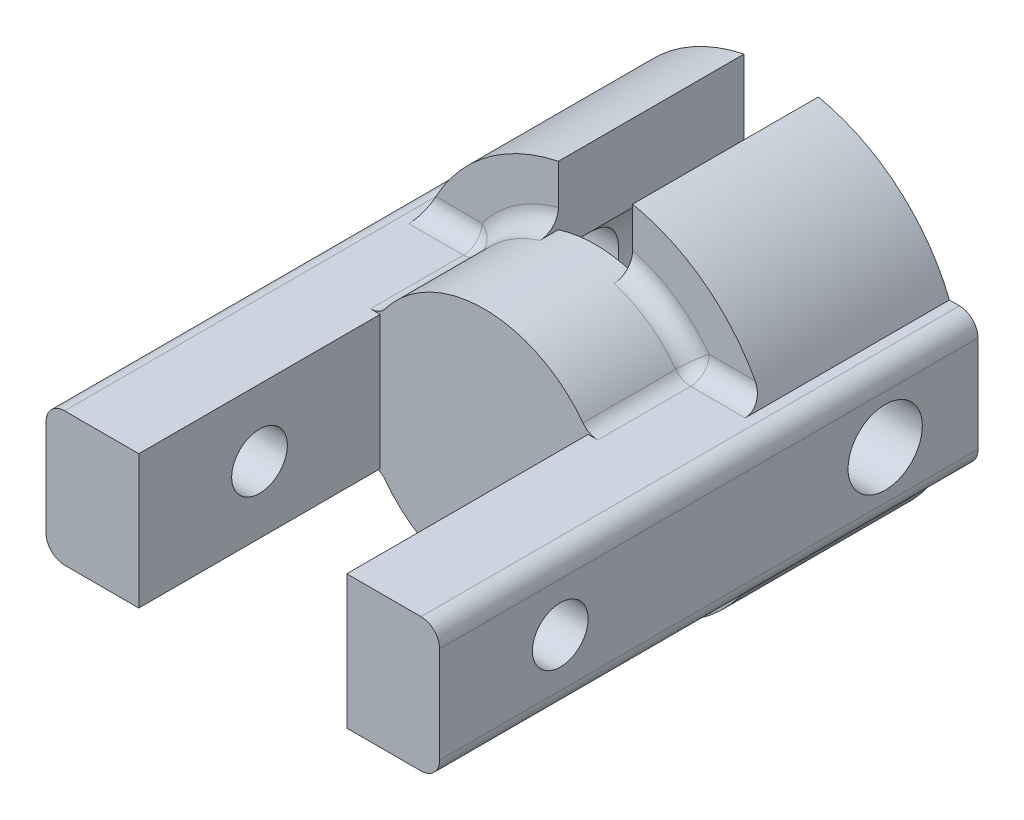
from build123d import *

# Parameters (mm, degrees)
BOSS_EXTRUDE1_DEPTH     = 6.5
BOSS_EXTRUDE2_DEPTH     = 8
BOSS_EXTRUDE3_START     = -5
BOSS_EXTRUDE3_DEPTH     = 5
SKETCH2_3_R             = 2.875
CUT_EXTRUDE1_DEPTH      = 7
CUT_EXTRUDE2_DEPTH      = 5
CUT_EXTRUDE3_DEPTH      = 15.111187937
CUT_EXTRUDE3_DEPTH_BACK = 15.111187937
SKETCH4_R               = 1
SKETCH4_R_2             = 0.75
FILLET1_R               = 0.5


with BuildPart() as part:
    # Sketch1 → Boss-Extrude1 (new body)
    with BuildSketch(Plane.XY):
        with BuildLine():
            Line((-5.3, -1.8), (-2.8, -1.8))
            ThreePointArc((-2.8, -1.8), (-3.328663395, 0), (-2.8, 1.8))
            Line((-2.8, 1.8), (-5.3, 1.8))
            Line((-5.3, 1.8), (-5.3, -1.8))
        make_face()
        with BuildLine():
            ThreePointArc((3.328663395, 0), (3.193764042, -0.938014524), (2.8, -1.8))
            Line((2.8, -1.8), (5.3, -1.8))
            Line((5.3, -1.8), (5.3, 1.8))
            Line((5.3, 1.8), (2.8, 1.8))
            ThreePointArc((2.8, 1.8), (3.193764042, 0.938014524), (3.328663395, 0))
        make_face()
        with BuildLine():
            ThreePointArc((-2.8, 1.8), (-3.328663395, 0), (-2.8, -1.8))
            Line((-2.8, -1.8), (-2.8, 1.8))
        make_face()
        with BuildLine():
            Line((2.8, 1.8), (2.8, -1.8))
            ThreePointArc((2.8, -1.8), (3.193764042, -0.938014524), (3.328663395, 0))
            ThreePointArc((3.328663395, 0), (3.193764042, 0.938014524), (2.8, 1.8))
        make_face()
    extrude(amount=BOSS_EXTRUDE1_DEPTH)

    # Sketch1_3 → Boss-Extrude2 (add)
    with BuildSketch(Plane.XY):
        with BuildLine():
            Line((-2.8, 1.8), (-2.8, -1.8))
            ThreePointArc((-2.8, -1.8), (0, -3.328663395), (2.8, -1.8))
            Line((2.8, -1.8), (2.8, 1.8))
            ThreePointArc((2.8, 1.8), (0, 3.328663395), (-2.8, 1.8))
        make_face()
        with BuildLine():
            ThreePointArc((3.328663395, 0), (3.193764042, -0.938014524), (2.8, -1.8))
            Line((2.8, -1.8), (5.3, -1.8))
            Line((5.3, -1.8), (5.3, 1.8))
            Line((5.3, 1.8), (2.8, 1.8))
            ThreePointArc((2.8, 1.8), (3.193764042, 0.938014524), (3.328663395, 0))
        make_face()
        with BuildLine():
            Line((2.8, 1.8), (2.8, -1.8))
            ThreePointArc((2.8, -1.8), (3.193764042, -0.938014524), (3.328663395, 0))
            ThreePointArc((3.328663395, 0), (3.193764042, 0.938014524), (2.8, 1.8))
        make_face()
        with BuildLine():
            ThreePointArc((-2.8, 1.8), (-3.328663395, 0), (-2.8, -1.8))
            Line((-2.8, -1.8), (-2.8, 1.8))
        make_face()
        with BuildLine():
            Line((-5.3, -1.8), (-2.8, -1.8))
            ThreePointArc((-2.8, -1.8), (-3.328663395, 0), (-2.8, 1.8))
            Line((-2.8, 1.8), (-5.3, 1.8))
            Line((-5.3, 1.8), (-5.3, -1.8))
        make_face()
    extrude(amount=-BOSS_EXTRUDE2_DEPTH)

    # Sketch2 → Boss-Extrude3 (add)
    with BuildSketch(Plane(origin=(0, 0, -8), x_dir=(-1, 0, 0), z_dir=(0, 0, -1)).offset(BOSS_EXTRUDE3_START)):
        with BuildLine():
            ThreePointArc((4.530521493, 1.8), (0, 4.875), (-4.530521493, 1.8))
            Line((-4.530521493, 1.8), (-2.8, 1.8))
            ThreePointArc((-2.8, 1.8), (0, 3.328663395), (2.8, 1.8))
            Line((2.8, 1.8), (4.530521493, 1.8))
        make_face()
        with BuildLine():
            Line((4.530521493, -1.8), (2.8, -1.8))
            ThreePointArc((2.8, -1.8), (0, -3.328663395), (-2.8, -1.8))
            Line((-2.8, -1.8), (-4.530521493, -1.8))
            ThreePointArc((-4.530521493, -1.8), (0, -4.875), (4.530521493, -1.8))
        make_face()
    extrude(amount=BOSS_EXTRUDE3_DEPTH)

    # Sketch2_3 → Cut-Extrude1 (cut)
    with BuildSketch(Plane(origin=(0, 0, -8), x_dir=(-1, 0, 0), z_dir=(0, 0, -1))):
        Circle(SKETCH2_3_R)
    extrude(amount=-CUT_EXTRUDE1_DEPTH, mode=Mode.SUBTRACT)

    # Sketch3 → Cut-Extrude2 (cut)
    with BuildSketch(Plane(origin=(0, 0, -8), x_dir=(-1, 0, 0), z_dir=(0, 0, -1))):
        with BuildLine():
            Line((0, 2.875), (0, 4.875))
            ThreePointArc((0, 4.875), (-0.502679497, 4.84901416), (-1, 4.771333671))
            Line((-1, 4.771333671), (-1, 2.695482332))
            ThreePointArc((-1, 2.695482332), (-0.507992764, 2.829764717), (0, 2.875))
        make_face()
        with BuildLine():
            ThreePointArc((1, 4.771333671), (0.502679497, 4.84901416), (0, 4.875))
            Line((0, 4.875), (0, 2.875))
            ThreePointArc((0, 2.875), (0.507992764, 2.829764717), (1, 2.695482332))
            Line((1, 2.695482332), (1, 4.771333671))
        make_face()
        with BuildLine():
            Line((0, -4.875), (0, -2.875))
            ThreePointArc((0, -2.875), (-0.507992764, -2.829764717), (-1, -2.695482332))
            Line((-1, -2.695482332), (-1, -4.771333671))
            ThreePointArc((-1, -4.771333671), (-0.502679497, -4.84901416), (0, -4.875))
        make_face()
        with BuildLine():
            ThreePointArc((1, -2.695482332), (0.507992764, -2.829764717), (0, -2.875))
            Line((0, -2.875), (0, -4.875))
            ThreePointArc((0, -4.875), (0.502679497, -4.84901416), (1, -4.771333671))
            Line((1, -4.771333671), (1, -2.695482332))
        make_face()
        with BuildLine():
            ThreePointArc((1, 2.695482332), (0.507992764, 2.829764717), (0, 2.875))
            Line((0, 2.875), (0, -2.875))
            ThreePointArc((0, -2.875), (0.507992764, -2.829764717), (1, -2.695482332))
            Line((1, -2.695482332), (1, 2.695482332))
        make_face()
        with BuildLine():
            Line((0, -2.875), (0, 2.875))
            ThreePointArc((0, 2.875), (-0.507992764, 2.829764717), (-1, 2.695482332))
            Line((-1, 2.695482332), (-1, -2.695482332))
            ThreePointArc((-1, -2.695482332), (-0.507992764, -2.829764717), (0, -2.875))
        make_face()
    extrude(amount=-CUT_EXTRUDE2_DEPTH, mode=Mode.SUBTRACT)

    # Sketch4 → Cut-Extrude3 (cut, two sides: drawn at the far end of the back side and taken through both)
    with BuildSketch(Plane.ZY.offset(5.3).offset(-CUT_EXTRUDE3_DEPTH_BACK)):
        with Locations(Location((-5.5, 0, 0), (0, 0, 270))):
            Circle(SKETCH4_R)
        with Locations(Location((3.25, 0, 0), (0, 0, 270))):
            Circle(SKETCH4_R_2)
    extrude(amount=CUT_EXTRUDE3_DEPTH + CUT_EXTRUDE3_DEPTH_BACK, mode=Mode.SUBTRACT)

    # Fillet1
    fillet1_edges = [part.edges().sort_by_distance(p)[0] for p in [
        (-5.3, -1.8, -0.75),
        (2.020541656, 2.645262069, -3),
        (-5.3, 1.8, -0.75),
        (5.3, 1.8, -0.75),
        (5.3, -1.8, -0.75),
        (2.8, 1.8, -1.5),
        (-2.8, 1.8, -1.5),
        (-3.665260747, 1.8, -3),
        (-2.020541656, 2.645262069, -3),
        (3.665260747, 1.8, -3),
        (2.8, -1.8, -1.5),
        (-2.8, -1.8, -1.5),
        (3.665260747, -1.8, -3),
        (2.020541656, -2.645262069, -3),
        (-3.665260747, -1.8, -3),
        (2.875, 0, -1),
        (-2.020541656, -2.645262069, -3),
    ]]
    fillet(fillet1_edges, radius=FILLET1_R)


solid = part.part
